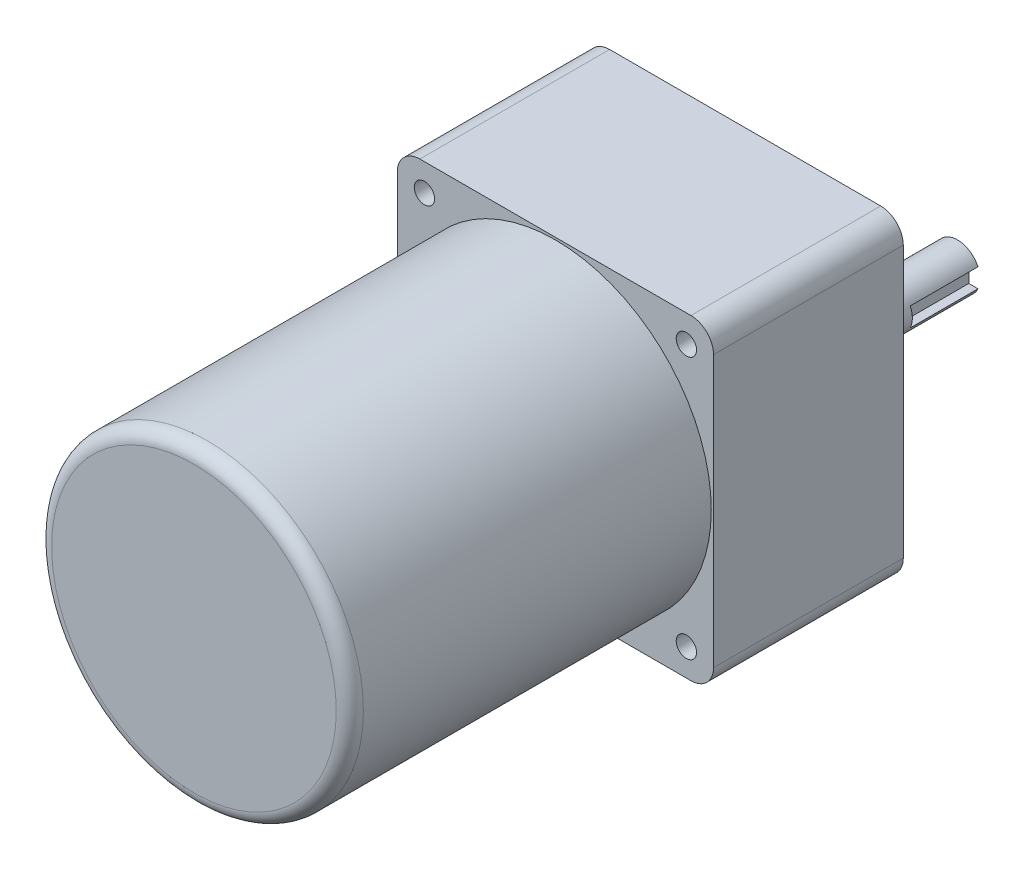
ISO-10303-21;
HEADER;
FILE_DESCRIPTION(('STEP AP214'),'2;1');
FILE_NAME('part.step','',(''),(''),'','','');
FILE_SCHEMA(('AUTOMOTIVE_DESIGN { 1 0 10303 214 1 1 1 1 }'));
ENDSEC;
DATA;
#1=APPLICATION_CONTEXT('core data for automotive mechanical design processes');
#2=APPLICATION_PROTOCOL_DEFINITION('international standard','automotive_design',2000,#1);
#3=PRODUCT_CONTEXT('',#1,'mechanical');
#4=PRODUCT('Part','Part','',(#3));
#5=PRODUCT_RELATED_PRODUCT_CATEGORY('part','',(#4));
#6=PRODUCT_DEFINITION_FORMATION('','',#4);
#7=PRODUCT_DEFINITION_CONTEXT('part definition',#1,'design');
#8=PRODUCT_DEFINITION('design','',#6,#7);
#9=PRODUCT_DEFINITION_SHAPE('','',#8);
#10=(LENGTH_UNIT() NAMED_UNIT(*) SI_UNIT(.MILLI.,.METRE.));
#11=(NAMED_UNIT(*) PLANE_ANGLE_UNIT() SI_UNIT($,.RADIAN.));
#12=(NAMED_UNIT(*) SI_UNIT($,.STERADIAN.) SOLID_ANGLE_UNIT());
#13=UNCERTAINTY_MEASURE_WITH_UNIT(LENGTH_MEASURE(1.E-05),#10,'distance_accuracy_value','');
#14=(GEOMETRIC_REPRESENTATION_CONTEXT(3) GLOBAL_UNCERTAINTY_ASSIGNED_CONTEXT((#13)) GLOBAL_UNIT_ASSIGNED_CONTEXT((#10,
#11,#12)) REPRESENTATION_CONTEXT('',''));
#15=CARTESIAN_POINT('',(0.,0.,0.));
#16=DIRECTION('',(0.,0.,1.));
#17=DIRECTION('',(1.,0.,0.));
#18=AXIS2_PLACEMENT_3D('',#15,#16,#17);
#19=CARTESIAN_POINT('',(15.0000000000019,0.,-3.));
#20=DIRECTION('',(0.,0.,-1.));
#21=DIRECTION('',(-1.,0.,0.));
#22=AXIS2_PLACEMENT_3D('',#19,#20,#21);
#23=PLANE('',#22);
#24=CARTESIAN_POINT('',(15.0000000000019,0.,-3.));
#25=DIRECTION('',(0.,0.,-1.));
#26=DIRECTION('',(-1.,0.,0.));
#27=AXIS2_PLACEMENT_3D('',#24,#25,#26);
#28=CIRCLE('',#27,14.5);
#29=CARTESIAN_POINT('',(0.500000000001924,0.,-3.));
#30=VERTEX_POINT('',#29);
#31=EDGE_CURVE('E42',#30,#30,#28,.T.);
#32=ORIENTED_EDGE('',*,*,#31,.T.);
#33=EDGE_LOOP('',(#32));
#34=FACE_BOUND('',#33,.T.);
#35=CARTESIAN_POINT('',(15.0000000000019,0.,-3.));
#36=DIRECTION('',(0.,0.,-1.));
#37=DIRECTION('',(-1.,0.,0.));
#38=AXIS2_PLACEMENT_3D('',#35,#36,#37);
#39=CIRCLE('',#38,5.);
#40=CARTESIAN_POINT('',(10.0000000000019,0.,-3.));
#41=VERTEX_POINT('',#40);
#42=EDGE_CURVE('E290',#41,#41,#39,.T.);
#43=ORIENTED_EDGE('',*,*,#42,.F.);
#44=EDGE_LOOP('',(#43));
#45=FACE_BOUND('',#44,.T.);
#46=ADVANCED_FACE('F34',(#34,#45),#23,.T.);
#47=CARTESIAN_POINT('',(-29.9999999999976,-30.0000000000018,0.));
#48=DIRECTION('',(0.,0.,1.));
#49=DIRECTION('',(1.,0.,0.));
#50=AXIS2_PLACEMENT_3D('',#47,#48,#49);
#51=PLANE('',#50);
#52=CARTESIAN_POINT('',(28.9913780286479,-28.9913780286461,0.));
#53=DIRECTION('',(0.,0.,1.));
#54=DIRECTION('',(1.,0.,0.));
#55=AXIS2_PLACEMENT_3D('',#52,#53,#54);
#56=CIRCLE('',#55,2.25000000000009);
#57=CARTESIAN_POINT('',(26.7413780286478,-28.9913780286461,0.));
#58=VERTEX_POINT('',#57);
#59=EDGE_CURVE('E283',#58,#58,#56,.T.);
#60=ORIENTED_EDGE('',*,*,#59,.T.);
#61=EDGE_LOOP('',(#60));
#62=FACE_BOUND('',#61,.T.);
#63=CARTESIAN_POINT('',(-28.9913780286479,28.9913780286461,0.));
#64=DIRECTION('',(0.,0.,1.));
#65=DIRECTION('',(1.,0.,0.));
#66=AXIS2_PLACEMENT_3D('',#63,#64,#65);
#67=CIRCLE('',#66,2.25000000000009);
#68=CARTESIAN_POINT('',(-31.241378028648,28.9913780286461,0.));
#69=VERTEX_POINT('',#68);
#70=EDGE_CURVE('E300',#69,#69,#67,.T.);
#71=ORIENTED_EDGE('',*,*,#70,.T.);
#72=EDGE_LOOP('',(#71));
#73=FACE_BOUND('',#72,.T.);
#74=CARTESIAN_POINT('',(-29.9999999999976,-30.0000000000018,0.));
#75=DIRECTION('',(0.,0.,1.));
#76=DIRECTION('',(1.,0.,0.));
#77=AXIS2_PLACEMENT_3D('',#74,#75,#76);
#78=CIRCLE('',#77,5.00000000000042);
#79=CARTESIAN_POINT('',(-34.9999999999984,-30.0000000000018,0.));
#80=VERTEX_POINT('',#79);
#81=CARTESIAN_POINT('',(-29.9999999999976,-35.0000000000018,0.));
#82=VERTEX_POINT('',#81);
#83=EDGE_CURVE('E145',#80,#82,#78,.T.);
#84=ORIENTED_EDGE('',*,*,#83,.F.);
#85=DIRECTION('',(0.,-1.,0.));
#86=VECTOR('',#85,1.);
#87=CARTESIAN_POINT('',(-34.9999999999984,-30.0000000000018,0.));
#88=LINE('',#87,#86);
#89=CARTESIAN_POINT('',(-34.9999999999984,30.,0.));
#90=VERTEX_POINT('',#89);
#91=EDGE_CURVE('E91',#90,#80,#88,.T.);
#92=ORIENTED_EDGE('',*,*,#91,.F.);
#93=CARTESIAN_POINT('',(-30.0000000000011,30.,0.));
#94=DIRECTION('',(0.,0.,1.));
#95=DIRECTION('',(1.,0.,0.));
#96=AXIS2_PLACEMENT_3D('',#93,#94,#95);
#97=CIRCLE('',#96,4.99999999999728);
#98=CARTESIAN_POINT('',(-30.0000000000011,34.9999999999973,0.));
#99=VERTEX_POINT('',#98);
#100=EDGE_CURVE('E158',#99,#90,#97,.T.);
#101=ORIENTED_EDGE('',*,*,#100,.F.);
#102=DIRECTION('',(-1.,0.,0.));
#103=VECTOR('',#102,1.);
#104=CARTESIAN_POINT('',(30.0000000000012,34.9999999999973,0.));
#105=LINE('',#104,#103);
#106=CARTESIAN_POINT('',(30.0000000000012,34.9999999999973,0.));
#107=VERTEX_POINT('',#106);
#108=EDGE_CURVE('E133',#107,#99,#105,.T.);
#109=ORIENTED_EDGE('',*,*,#108,.F.);
#110=CARTESIAN_POINT('',(30.0000000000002,29.9999999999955,0.));
#111=DIRECTION('',(0.,0.,1.));
#112=DIRECTION('',(1.,0.,0.));
#113=AXIS2_PLACEMENT_3D('',#110,#111,#112);
#114=CIRCLE('',#113,5.0000000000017);
#115=CARTESIAN_POINT('',(35.0000000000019,30.,0.));
#116=VERTEX_POINT('',#115);
#117=EDGE_CURVE('E155',#116,#107,#114,.T.);
#118=ORIENTED_EDGE('',*,*,#117,.F.);
#119=DIRECTION('',(0.,1.,0.));
#120=VECTOR('',#119,1.);
#121=CARTESIAN_POINT('',(35.0000000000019,-30.0000000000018,0.));
#122=LINE('',#121,#120);
#123=CARTESIAN_POINT('',(35.0000000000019,-30.0000000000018,0.));
#124=VERTEX_POINT('',#123);
#125=EDGE_CURVE('E153',#124,#116,#122,.T.);
#126=ORIENTED_EDGE('',*,*,#125,.F.);
#127=CARTESIAN_POINT('',(30.000000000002,-30.0000000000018,0.));
#128=DIRECTION('',(0.,0.,1.));
#129=DIRECTION('',(1.,0.,0.));
#130=AXIS2_PLACEMENT_3D('',#127,#128,#129);
#131=CIRCLE('',#130,4.99999999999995);
#132=CARTESIAN_POINT('',(30.000000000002,-35.0000000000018,0.));
#133=VERTEX_POINT('',#132);
#134=EDGE_CURVE('E151',#133,#124,#131,.T.);
#135=ORIENTED_EDGE('',*,*,#134,.F.);
#136=DIRECTION('',(1.,0.,0.));
#137=VECTOR('',#136,1.);
#138=CARTESIAN_POINT('',(30.000000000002,-35.0000000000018,0.));
#139=LINE('',#138,#137);
#140=EDGE_CURVE('E148',#82,#133,#139,.T.);
#141=ORIENTED_EDGE('',*,*,#140,.F.);
#142=EDGE_LOOP('',(#84,#92,#101,#109,#118,#126,#135,#141));
#143=FACE_BOUND('',#142,.T.);
#144=CARTESIAN_POINT('',(28.9913780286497,28.9913780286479,0.));
#145=DIRECTION('',(0.,0.,1.));
#146=DIRECTION('',(1.,0.,0.));
#147=AXIS2_PLACEMENT_3D('',#144,#145,#146);
#148=CIRCLE('',#147,2.25000000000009);
#149=CARTESIAN_POINT('',(26.7413780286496,28.9913780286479,0.));
#150=VERTEX_POINT('',#149);
#151=EDGE_CURVE('E306',#150,#150,#148,.T.);
#152=ORIENTED_EDGE('',*,*,#151,.T.);
#153=EDGE_LOOP('',(#152));
#154=FACE_BOUND('',#153,.T.);
#155=CARTESIAN_POINT('',(-28.9913780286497,-28.9913780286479,0.));
#156=DIRECTION('',(0.,0.,1.));
#157=DIRECTION('',(1.,0.,0.));
#158=AXIS2_PLACEMENT_3D('',#155,#156,#157);
#159=CIRCLE('',#158,2.25000000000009);
#160=CARTESIAN_POINT('',(-31.2413780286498,-28.9913780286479,0.));
#161=VERTEX_POINT('',#160);
#162=EDGE_CURVE('E295',#161,#161,#159,.T.);
#163=ORIENTED_EDGE('',*,*,#162,.T.);
#164=EDGE_LOOP('',(#163));
#165=FACE_BOUND('',#164,.T.);
#166=CARTESIAN_POINT('',(15.0000000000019,0.,0.));
#167=DIRECTION('',(0.,0.,1.));
#168=DIRECTION('',(1.,0.,0.));
#169=AXIS2_PLACEMENT_3D('',#166,#167,#168);
#170=CIRCLE('',#169,15.);
#171=CARTESIAN_POINT('',(30.0000000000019,0.,0.));
#172=VERTEX_POINT('',#171);
#173=EDGE_CURVE('E182',#172,#172,#170,.F.);
#174=ORIENTED_EDGE('',*,*,#173,.F.);
#175=EDGE_LOOP('',(#174));
#176=FACE_BOUND('',#175,.T.);
#177=ADVANCED_FACE('F205',(#62,#73,#143,#154,#165,#176),#51,.F.);
#178=CARTESIAN_POINT('',(-29.9999999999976,-30.0000000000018,42.));
#179=DIRECTION('',(0.,0.,1.));
#180=DIRECTION('',(1.,0.,0.));
#181=AXIS2_PLACEMENT_3D('',#178,#179,#180);
#182=PLANE('',#181);
#183=CARTESIAN_POINT('',(28.9913780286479,-28.9913780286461,42.));
#184=DIRECTION('',(0.,0.,1.));
#185=DIRECTION('',(1.,0.,0.));
#186=AXIS2_PLACEMENT_3D('',#183,#184,#185);
#187=CIRCLE('',#186,2.25000000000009);
#188=CARTESIAN_POINT('',(26.7413780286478,-28.9913780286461,42.));
#189=VERTEX_POINT('',#188);
#190=EDGE_CURVE('E287',#189,#189,#187,.T.);
#191=ORIENTED_EDGE('',*,*,#190,.F.);
#192=EDGE_LOOP('',(#191));
#193=FACE_BOUND('',#192,.T.);
#194=CARTESIAN_POINT('',(-28.9913780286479,28.9913780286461,42.));
#195=DIRECTION('',(0.,0.,1.));
#196=DIRECTION('',(1.,0.,0.));
#197=AXIS2_PLACEMENT_3D('',#194,#195,#196);
#198=CIRCLE('',#197,2.25000000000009);
#199=CARTESIAN_POINT('',(-31.241378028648,28.9913780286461,42.));
#200=VERTEX_POINT('',#199);
#201=EDGE_CURVE('E303',#200,#200,#198,.T.);
#202=ORIENTED_EDGE('',*,*,#201,.F.);
#203=EDGE_LOOP('',(#202));
#204=FACE_BOUND('',#203,.T.);
#205=CARTESIAN_POINT('',(-29.9999999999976,-30.0000000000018,42.));
#206=DIRECTION('',(0.,0.,1.));
#207=DIRECTION('',(1.,0.,0.));
#208=AXIS2_PLACEMENT_3D('',#205,#206,#207);
#209=CIRCLE('',#208,5.00000000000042);
#210=CARTESIAN_POINT('',(-34.9999999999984,-30.0000000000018,42.));
#211=VERTEX_POINT('',#210);
#212=CARTESIAN_POINT('',(-29.9999999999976,-35.0000000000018,42.));
#213=VERTEX_POINT('',#212);
#214=EDGE_CURVE('E161',#211,#213,#209,.T.);
#215=ORIENTED_EDGE('',*,*,#214,.T.);
#216=DIRECTION('',(1.,0.,0.));
#217=VECTOR('',#216,1.);
#218=CARTESIAN_POINT('',(30.000000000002,-35.0000000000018,42.));
#219=LINE('',#218,#217);
#220=CARTESIAN_POINT('',(30.000000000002,-35.0000000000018,42.));
#221=VERTEX_POINT('',#220);
#222=EDGE_CURVE('E100',#213,#221,#219,.T.);
#223=ORIENTED_EDGE('',*,*,#222,.T.);
#224=CARTESIAN_POINT('',(30.000000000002,-30.0000000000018,42.));
#225=DIRECTION('',(0.,0.,1.));
#226=DIRECTION('',(1.,0.,0.));
#227=AXIS2_PLACEMENT_3D('',#224,#225,#226);
#228=CIRCLE('',#227,4.99999999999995);
#229=CARTESIAN_POINT('',(35.0000000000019,-30.0000000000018,42.));
#230=VERTEX_POINT('',#229);
#231=EDGE_CURVE('E315',#221,#230,#228,.T.);
#232=ORIENTED_EDGE('',*,*,#231,.T.);
#233=DIRECTION('',(0.,1.,0.));
#234=VECTOR('',#233,1.);
#235=CARTESIAN_POINT('',(35.0000000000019,-30.0000000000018,42.));
#236=LINE('',#235,#234);
#237=CARTESIAN_POINT('',(35.0000000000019,30.,42.));
#238=VERTEX_POINT('',#237);
#239=EDGE_CURVE('E317',#230,#238,#236,.T.);
#240=ORIENTED_EDGE('',*,*,#239,.T.);
#241=CARTESIAN_POINT('',(30.0000000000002,29.9999999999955,42.));
#242=DIRECTION('',(0.,0.,1.));
#243=DIRECTION('',(1.,0.,0.));
#244=AXIS2_PLACEMENT_3D('',#241,#242,#243);
#245=CIRCLE('',#244,5.0000000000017);
#246=CARTESIAN_POINT('',(30.0000000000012,34.9999999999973,42.));
#247=VERTEX_POINT('',#246);
#248=EDGE_CURVE('E124',#238,#247,#245,.T.);
#249=ORIENTED_EDGE('',*,*,#248,.T.);
#250=DIRECTION('',(-1.,0.,0.));
#251=VECTOR('',#250,1.);
#252=CARTESIAN_POINT('',(30.0000000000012,34.9999999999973,42.));
#253=LINE('',#252,#251);
#254=CARTESIAN_POINT('',(-30.0000000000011,34.9999999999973,42.));
#255=VERTEX_POINT('',#254);
#256=EDGE_CURVE('E116',#247,#255,#253,.T.);
#257=ORIENTED_EDGE('',*,*,#256,.T.);
#258=CARTESIAN_POINT('',(-30.0000000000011,30.,42.));
#259=DIRECTION('',(0.,0.,1.));
#260=DIRECTION('',(1.,0.,0.));
#261=AXIS2_PLACEMENT_3D('',#258,#259,#260);
#262=CIRCLE('',#261,4.99999999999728);
#263=CARTESIAN_POINT('',(-34.9999999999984,30.,42.));
#264=VERTEX_POINT('',#263);
#265=EDGE_CURVE('E121',#255,#264,#262,.T.);
#266=ORIENTED_EDGE('',*,*,#265,.T.);
#267=DIRECTION('',(0.,-1.,0.));
#268=VECTOR('',#267,1.);
#269=CARTESIAN_POINT('',(-34.9999999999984,-30.0000000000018,42.));
#270=LINE('',#269,#268);
#271=EDGE_CURVE('E58',#264,#211,#270,.T.);
#272=ORIENTED_EDGE('',*,*,#271,.T.);
#273=EDGE_LOOP('',(#215,#223,#232,#240,#249,#257,#266,#272));
#274=FACE_BOUND('',#273,.T.);
#275=CARTESIAN_POINT('',(28.9913780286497,28.9913780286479,42.));
#276=DIRECTION('',(0.,0.,1.));
#277=DIRECTION('',(1.,0.,0.));
#278=AXIS2_PLACEMENT_3D('',#275,#276,#277);
#279=CIRCLE('',#278,2.25000000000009);
#280=CARTESIAN_POINT('',(26.7413780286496,28.9913780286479,42.));
#281=VERTEX_POINT('',#280);
#282=EDGE_CURVE('E149',#281,#281,#279,.T.);
#283=ORIENTED_EDGE('',*,*,#282,.F.);
#284=EDGE_LOOP('',(#283));
#285=FACE_BOUND('',#284,.T.);
#286=CARTESIAN_POINT('',(-28.9913780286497,-28.9913780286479,42.));
#287=DIRECTION('',(0.,0.,1.));
#288=DIRECTION('',(1.,0.,0.));
#289=AXIS2_PLACEMENT_3D('',#286,#287,#288);
#290=CIRCLE('',#289,2.25000000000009);
#291=CARTESIAN_POINT('',(-31.2413780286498,-28.9913780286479,42.));
#292=VERTEX_POINT('',#291);
#293=EDGE_CURVE('E297',#292,#292,#290,.T.);
#294=ORIENTED_EDGE('',*,*,#293,.F.);
#295=EDGE_LOOP('',(#294));
#296=FACE_BOUND('',#295,.T.);
#297=CARTESIAN_POINT('',(1.77635683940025E-12,0.,42.));
#298=DIRECTION('',(0.,0.,1.));
#299=DIRECTION('',(1.,0.,0.));
#300=AXIS2_PLACEMENT_3D('',#297,#298,#299);
#301=CIRCLE('',#300,34.5);
#302=CARTESIAN_POINT('',(34.5000000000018,0.,42.));
#303=VERTEX_POINT('',#302);
#304=EDGE_CURVE('E281',#303,#303,#301,.T.);
#305=ORIENTED_EDGE('',*,*,#304,.F.);
#306=EDGE_LOOP('',(#305));
#307=FACE_BOUND('',#306,.T.);
#308=ADVANCED_FACE('F118',(#193,#204,#274,#285,#296,#307),#182,.T.);
#309=CARTESIAN_POINT('',(-29.9999999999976,-30.0000000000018,42.));
#310=DIRECTION('',(0.,0.,-1.));
#311=DIRECTION('',(-1.,0.,0.));
#312=AXIS2_PLACEMENT_3D('',#309,#310,#311);
#313=CYLINDRICAL_SURFACE('',#312,5.00000000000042);
#314=ORIENTED_EDGE('',*,*,#83,.T.);
#315=DIRECTION('',(0.,0.,-1.));
#316=VECTOR('',#315,1.);
#317=CARTESIAN_POINT('',(-29.9999999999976,-35.0000000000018,42.));
#318=LINE('',#317,#316);
#319=EDGE_CURVE('E174',#213,#82,#318,.T.);
#320=ORIENTED_EDGE('',*,*,#319,.F.);
#321=ORIENTED_EDGE('',*,*,#214,.F.);
#322=DIRECTION('',(0.,0.,-1.));
#323=VECTOR('',#322,1.);
#324=CARTESIAN_POINT('',(-34.9999999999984,-30.0000000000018,42.));
#325=LINE('',#324,#323);
#326=EDGE_CURVE('E141',#211,#80,#325,.T.);
#327=ORIENTED_EDGE('',*,*,#326,.T.);
#328=EDGE_LOOP('',(#314,#320,#321,#327));
#329=FACE_BOUND('',#328,.T.);
#330=ADVANCED_FACE('F245',(#329),#313,.T.);
#331=CARTESIAN_POINT('',(30.000000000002,-35.0000000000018,42.));
#332=DIRECTION('',(0.,1.,0.));
#333=DIRECTION('',(0.,0.,1.));
#334=AXIS2_PLACEMENT_3D('',#331,#332,#333);
#335=PLANE('',#334);
#336=ORIENTED_EDGE('',*,*,#140,.T.);
#337=DIRECTION('',(0.,0.,-1.));
#338=VECTOR('',#337,1.);
#339=CARTESIAN_POINT('',(30.000000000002,-35.0000000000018,42.));
#340=LINE('',#339,#338);
#341=EDGE_CURVE('E171',#221,#133,#340,.T.);
#342=ORIENTED_EDGE('',*,*,#341,.F.);
#343=ORIENTED_EDGE('',*,*,#222,.F.);
#344=ORIENTED_EDGE('',*,*,#319,.T.);
#345=EDGE_LOOP('',(#336,#342,#343,#344));
#346=FACE_BOUND('',#345,.T.);
#347=ADVANCED_FACE('F265',(#346),#335,.F.);
#348=CARTESIAN_POINT('',(30.000000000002,-30.0000000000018,42.));
#349=DIRECTION('',(0.,0.,-1.));
#350=DIRECTION('',(-1.,0.,0.));
#351=AXIS2_PLACEMENT_3D('',#348,#349,#350);
#352=CYLINDRICAL_SURFACE('',#351,4.99999999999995);
#353=ORIENTED_EDGE('',*,*,#134,.T.);
#354=DIRECTION('',(0.,0.,-1.));
#355=VECTOR('',#354,1.);
#356=CARTESIAN_POINT('',(35.0000000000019,-30.0000000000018,42.));
#357=LINE('',#356,#355);
#358=EDGE_CURVE('E168',#230,#124,#357,.T.);
#359=ORIENTED_EDGE('',*,*,#358,.F.);
#360=ORIENTED_EDGE('',*,*,#231,.F.);
#361=ORIENTED_EDGE('',*,*,#341,.T.);
#362=EDGE_LOOP('',(#353,#359,#360,#361));
#363=FACE_BOUND('',#362,.T.);
#364=ADVANCED_FACE('F261',(#363),#352,.T.);
#365=CARTESIAN_POINT('',(35.0000000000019,-30.0000000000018,42.));
#366=DIRECTION('',(-1.,0.,0.));
#367=DIRECTION('',(0.,0.,1.));
#368=AXIS2_PLACEMENT_3D('',#365,#366,#367);
#369=PLANE('',#368);
#370=ORIENTED_EDGE('',*,*,#125,.T.);
#371=DIRECTION('',(0.,0.,-1.));
#372=VECTOR('',#371,1.);
#373=CARTESIAN_POINT('',(35.0000000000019,30.,42.));
#374=LINE('',#373,#372);
#375=EDGE_CURVE('E165',#238,#116,#374,.T.);
#376=ORIENTED_EDGE('',*,*,#375,.F.);
#377=ORIENTED_EDGE('',*,*,#239,.F.);
#378=ORIENTED_EDGE('',*,*,#358,.T.);
#379=EDGE_LOOP('',(#370,#376,#377,#378));
#380=FACE_BOUND('',#379,.T.);
#381=ADVANCED_FACE('F257',(#380),#369,.F.);
#382=CARTESIAN_POINT('',(30.0000000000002,29.9999999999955,42.));
#383=DIRECTION('',(0.,0.,-1.));
#384=DIRECTION('',(-1.,0.,0.));
#385=AXIS2_PLACEMENT_3D('',#382,#383,#384);
#386=CYLINDRICAL_SURFACE('',#385,5.0000000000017);
#387=ORIENTED_EDGE('',*,*,#117,.T.);
#388=DIRECTION('',(0.,0.,-1.));
#389=VECTOR('',#388,1.);
#390=CARTESIAN_POINT('',(30.0000000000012,34.9999999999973,42.));
#391=LINE('',#390,#389);
#392=EDGE_CURVE('E136',#247,#107,#391,.T.);
#393=ORIENTED_EDGE('',*,*,#392,.F.);
#394=ORIENTED_EDGE('',*,*,#248,.F.);
#395=ORIENTED_EDGE('',*,*,#375,.T.);
#396=EDGE_LOOP('',(#387,#393,#394,#395));
#397=FACE_BOUND('',#396,.T.);
#398=ADVANCED_FACE('F254',(#397),#386,.T.);
#399=CARTESIAN_POINT('',(30.0000000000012,34.9999999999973,42.));
#400=DIRECTION('',(0.,-1.,0.));
#401=DIRECTION('',(0.,0.,-1.));
#402=AXIS2_PLACEMENT_3D('',#399,#400,#401);
#403=PLANE('',#402);
#404=ORIENTED_EDGE('',*,*,#108,.T.);
#405=DIRECTION('',(0.,0.,-1.));
#406=VECTOR('',#405,1.);
#407=CARTESIAN_POINT('',(-30.0000000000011,34.9999999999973,42.));
#408=LINE('',#407,#406);
#409=EDGE_CURVE('E130',#255,#99,#408,.T.);
#410=ORIENTED_EDGE('',*,*,#409,.F.);
#411=ORIENTED_EDGE('',*,*,#256,.F.);
#412=ORIENTED_EDGE('',*,*,#392,.T.);
#413=EDGE_LOOP('',(#404,#410,#411,#412));
#414=FACE_BOUND('',#413,.T.);
#415=ADVANCED_FACE('F131',(#414),#403,.F.);
#416=CARTESIAN_POINT('',(-30.0000000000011,30.,42.));
#417=DIRECTION('',(0.,0.,-1.));
#418=DIRECTION('',(-1.,0.,0.));
#419=AXIS2_PLACEMENT_3D('',#416,#417,#418);
#420=CYLINDRICAL_SURFACE('',#419,4.99999999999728);
#421=ORIENTED_EDGE('',*,*,#100,.T.);
#422=DIRECTION('',(0.,0.,-1.));
#423=VECTOR('',#422,1.);
#424=CARTESIAN_POINT('',(-34.9999999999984,30.,42.));
#425=LINE('',#424,#423);
#426=EDGE_CURVE('E137',#264,#90,#425,.T.);
#427=ORIENTED_EDGE('',*,*,#426,.F.);
#428=ORIENTED_EDGE('',*,*,#265,.F.);
#429=ORIENTED_EDGE('',*,*,#409,.T.);
#430=EDGE_LOOP('',(#421,#427,#428,#429));
#431=FACE_BOUND('',#430,.T.);
#432=ADVANCED_FACE('F139',(#431),#420,.T.);
#433=CARTESIAN_POINT('',(-34.9999999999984,-30.0000000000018,42.));
#434=DIRECTION('',(1.,0.,0.));
#435=DIRECTION('',(0.,0.,-1.));
#436=AXIS2_PLACEMENT_3D('',#433,#434,#435);
#437=PLANE('',#436);
#438=ORIENTED_EDGE('',*,*,#91,.T.);
#439=ORIENTED_EDGE('',*,*,#326,.F.);
#440=ORIENTED_EDGE('',*,*,#271,.F.);
#441=ORIENTED_EDGE('',*,*,#426,.T.);
#442=EDGE_LOOP('',(#438,#439,#440,#441));
#443=FACE_BOUND('',#442,.T.);
#444=ADVANCED_FACE('F242',(#443),#437,.F.);
#445=CARTESIAN_POINT('',(28.9913780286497,28.9913780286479,42.));
#446=DIRECTION('',(0.,0.,-1.));
#447=DIRECTION('',(-1.,0.,0.));
#448=AXIS2_PLACEMENT_3D('',#445,#446,#447);
#449=CYLINDRICAL_SURFACE('',#448,2.25000000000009);
#450=CARTESIAN_POINT('',(26.7413780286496,28.9913780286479,42.));
#451=CARTESIAN_POINT('',(26.7413780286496,28.9913780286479,41.5625));
#452=CARTESIAN_POINT('',(26.7413780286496,28.9913780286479,41.125));
#453=CARTESIAN_POINT('',(26.7413780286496,28.9913780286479,40.25));
#454=CARTESIAN_POINT('',(26.7413780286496,28.9913780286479,39.8125));
#455=CARTESIAN_POINT('',(26.7413780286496,28.9913780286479,38.9375));
#456=CARTESIAN_POINT('',(26.7413780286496,28.9913780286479,38.5));
#457=CARTESIAN_POINT('',(26.7413780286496,28.9913780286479,37.625));
#458=CARTESIAN_POINT('',(26.7413780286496,28.9913780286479,37.1875));
#459=CARTESIAN_POINT('',(26.7413780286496,28.9913780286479,36.3125));
#460=CARTESIAN_POINT('',(26.7413780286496,28.9913780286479,35.875));
#461=CARTESIAN_POINT('',(26.7413780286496,28.9913780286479,35.));
#462=CARTESIAN_POINT('',(26.7413780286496,28.9913780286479,34.5625));
#463=CARTESIAN_POINT('',(26.7413780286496,28.9913780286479,33.6875));
#464=CARTESIAN_POINT('',(26.7413780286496,28.9913780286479,33.25));
#465=CARTESIAN_POINT('',(26.7413780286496,28.9913780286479,32.375));
#466=CARTESIAN_POINT('',(26.7413780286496,28.9913780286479,31.9375));
#467=CARTESIAN_POINT('',(26.7413780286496,28.9913780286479,31.0625));
#468=CARTESIAN_POINT('',(26.7413780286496,28.9913780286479,30.625));
#469=CARTESIAN_POINT('',(26.7413780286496,28.9913780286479,29.75));
#470=CARTESIAN_POINT('',(26.7413780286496,28.9913780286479,29.3125));
#471=CARTESIAN_POINT('',(26.7413780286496,28.9913780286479,28.4375));
#472=CARTESIAN_POINT('',(26.7413780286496,28.9913780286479,28.));
#473=CARTESIAN_POINT('',(26.7413780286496,28.9913780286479,27.125));
#474=CARTESIAN_POINT('',(26.7413780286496,28.9913780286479,26.6875));
#475=CARTESIAN_POINT('',(26.7413780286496,28.9913780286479,25.8125));
#476=CARTESIAN_POINT('',(26.7413780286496,28.9913780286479,25.375));
#477=CARTESIAN_POINT('',(26.7413780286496,28.9913780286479,24.5));
#478=CARTESIAN_POINT('',(26.7413780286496,28.9913780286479,24.0625));
#479=CARTESIAN_POINT('',(26.7413780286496,28.9913780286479,23.1875));
#480=CARTESIAN_POINT('',(26.7413780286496,28.9913780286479,22.75));
#481=CARTESIAN_POINT('',(26.7413780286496,28.9913780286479,21.875));
#482=CARTESIAN_POINT('',(26.7413780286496,28.9913780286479,21.4375));
#483=CARTESIAN_POINT('',(26.7413780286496,28.9913780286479,20.5625));
#484=CARTESIAN_POINT('',(26.7413780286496,28.9913780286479,20.125));
#485=CARTESIAN_POINT('',(26.7413780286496,28.9913780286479,19.25));
#486=CARTESIAN_POINT('',(26.7413780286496,28.9913780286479,18.8125));
#487=CARTESIAN_POINT('',(26.7413780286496,28.9913780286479,17.9375));
#488=CARTESIAN_POINT('',(26.7413780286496,28.9913780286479,17.5));
#489=CARTESIAN_POINT('',(26.7413780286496,28.9913780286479,16.625));
#490=CARTESIAN_POINT('',(26.7413780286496,28.9913780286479,16.1875));
#491=CARTESIAN_POINT('',(26.7413780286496,28.9913780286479,15.3125));
#492=CARTESIAN_POINT('',(26.7413780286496,28.9913780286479,14.875));
#493=CARTESIAN_POINT('',(26.7413780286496,28.9913780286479,14.));
#494=CARTESIAN_POINT('',(26.7413780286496,28.9913780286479,13.5625));
#495=CARTESIAN_POINT('',(26.7413780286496,28.9913780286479,12.6875));
#496=CARTESIAN_POINT('',(26.7413780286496,28.9913780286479,12.25));
#497=CARTESIAN_POINT('',(26.7413780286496,28.9913780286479,11.375));
#498=CARTESIAN_POINT('',(26.7413780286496,28.9913780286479,10.9375));
#499=CARTESIAN_POINT('',(26.7413780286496,28.9913780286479,10.0625));
#500=CARTESIAN_POINT('',(26.7413780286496,28.9913780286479,9.625));
#501=CARTESIAN_POINT('',(26.7413780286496,28.9913780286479,8.75));
#502=CARTESIAN_POINT('',(26.7413780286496,28.9913780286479,8.3125));
#503=CARTESIAN_POINT('',(26.7413780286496,28.9913780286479,7.4375));
#504=CARTESIAN_POINT('',(26.7413780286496,28.9913780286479,7.));
#505=CARTESIAN_POINT('',(26.7413780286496,28.9913780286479,6.125));
#506=CARTESIAN_POINT('',(26.7413780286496,28.9913780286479,5.6875));
#507=CARTESIAN_POINT('',(26.7413780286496,28.9913780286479,4.8125));
#508=CARTESIAN_POINT('',(26.7413780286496,28.9913780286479,4.375));
#509=CARTESIAN_POINT('',(26.7413780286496,28.9913780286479,3.5));
#510=CARTESIAN_POINT('',(26.7413780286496,28.9913780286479,3.0625));
#511=CARTESIAN_POINT('',(26.7413780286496,28.9913780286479,2.1875));
#512=CARTESIAN_POINT('',(26.7413780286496,28.9913780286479,1.75));
#513=CARTESIAN_POINT('',(26.7413780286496,28.9913780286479,0.875000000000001));
#514=CARTESIAN_POINT('',(26.7413780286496,28.9913780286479,0.4375));
#515=CARTESIAN_POINT('',(26.7413780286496,28.9913780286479,0.));
#516=B_SPLINE_CURVE_WITH_KNOTS('',3,(#450,#451,#452,#453,#454,#455,#456,#457,#458,#459,#460,
#461,#462,#463,#464,#465,#466,#467,#468,#469,#470,#471,#472,#473,#474,#475,#476,#477,#478,#479,
#480,#481,#482,#483,#484,#485,#486,#487,#488,#489,#490,#491,#492,#493,#494,#495,#496,#497,#498,
#499,#500,#501,#502,#503,#504,#505,#506,#507,#508,#509,#510,#511,#512,#513,#514,#515),
.UNSPECIFIED.,.F.,.F.,(4,2,2,2,2,2,2,2,2,2,2,2,2,2,2,2,2,2,2,2,2,2,2,2,2,2,2,2,2,2,2,2,4),(0.,
1.31249999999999,2.625,3.9375,5.25,6.5625,7.87499999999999,9.18749999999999,10.5,11.8125,13.125,
14.4375,15.75,17.0625,18.375,19.6875,21.,22.3125,23.625,24.9375,26.25,27.5625,28.875,30.1875,
31.5,32.8125,34.125,35.4375,36.75,38.0625,39.375,40.6875,42.),.UNSPECIFIED.);
#517=EDGE_CURVE('BSEAM238',#281,#150,#516,.T.);
#518=ORIENTED_EDGE('',*,*,#282,.T.);
#519=ORIENTED_EDGE('',*,*,#151,.F.);
#520=ORIENTED_EDGE('',*,*,#517,.T.);
#521=ORIENTED_EDGE('',*,*,#517,.F.);
#522=EDGE_LOOP('',(#518,#520,#519,#521));
#523=FACE_BOUND('',#522,.T.);
#524=ADVANCED_FACE('F238',(#523),#449,.F.);
#525=CARTESIAN_POINT('',(-28.9913780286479,28.9913780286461,42.));
#526=DIRECTION('',(0.,0.,-1.));
#527=DIRECTION('',(-1.,0.,0.));
#528=AXIS2_PLACEMENT_3D('',#525,#526,#527);
#529=CYLINDRICAL_SURFACE('',#528,2.25000000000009);
#530=CARTESIAN_POINT('',(-31.241378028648,28.9913780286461,42.));
#531=CARTESIAN_POINT('',(-31.241378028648,28.9913780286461,41.5625));
#532=CARTESIAN_POINT('',(-31.241378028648,28.9913780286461,41.125));
#533=CARTESIAN_POINT('',(-31.241378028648,28.9913780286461,40.25));
#534=CARTESIAN_POINT('',(-31.241378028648,28.9913780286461,39.8125));
#535=CARTESIAN_POINT('',(-31.241378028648,28.9913780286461,38.9375));
#536=CARTESIAN_POINT('',(-31.241378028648,28.9913780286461,38.5));
#537=CARTESIAN_POINT('',(-31.241378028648,28.9913780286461,37.625));
#538=CARTESIAN_POINT('',(-31.241378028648,28.9913780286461,37.1875));
#539=CARTESIAN_POINT('',(-31.241378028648,28.9913780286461,36.3125));
#540=CARTESIAN_POINT('',(-31.241378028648,28.9913780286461,35.875));
#541=CARTESIAN_POINT('',(-31.241378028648,28.9913780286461,35.));
#542=CARTESIAN_POINT('',(-31.241378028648,28.9913780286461,34.5625));
#543=CARTESIAN_POINT('',(-31.241378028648,28.9913780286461,33.6875));
#544=CARTESIAN_POINT('',(-31.241378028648,28.9913780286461,33.25));
#545=CARTESIAN_POINT('',(-31.241378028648,28.9913780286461,32.375));
#546=CARTESIAN_POINT('',(-31.241378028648,28.9913780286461,31.9375));
#547=CARTESIAN_POINT('',(-31.241378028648,28.9913780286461,31.0625));
#548=CARTESIAN_POINT('',(-31.241378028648,28.9913780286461,30.625));
#549=CARTESIAN_POINT('',(-31.241378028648,28.9913780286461,29.75));
#550=CARTESIAN_POINT('',(-31.241378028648,28.9913780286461,29.3125));
#551=CARTESIAN_POINT('',(-31.241378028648,28.9913780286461,28.4375));
#552=CARTESIAN_POINT('',(-31.241378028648,28.9913780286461,28.));
#553=CARTESIAN_POINT('',(-31.241378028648,28.9913780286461,27.125));
#554=CARTESIAN_POINT('',(-31.241378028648,28.9913780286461,26.6875));
#555=CARTESIAN_POINT('',(-31.241378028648,28.9913780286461,25.8125));
#556=CARTESIAN_POINT('',(-31.241378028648,28.9913780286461,25.375));
#557=CARTESIAN_POINT('',(-31.241378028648,28.9913780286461,24.5));
#558=CARTESIAN_POINT('',(-31.241378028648,28.9913780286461,24.0625));
#559=CARTESIAN_POINT('',(-31.241378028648,28.9913780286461,23.1875));
#560=CARTESIAN_POINT('',(-31.241378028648,28.9913780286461,22.75));
#561=CARTESIAN_POINT('',(-31.241378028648,28.9913780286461,21.875));
#562=CARTESIAN_POINT('',(-31.241378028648,28.9913780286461,21.4375));
#563=CARTESIAN_POINT('',(-31.241378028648,28.9913780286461,20.5625));
#564=CARTESIAN_POINT('',(-31.241378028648,28.9913780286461,20.125));
#565=CARTESIAN_POINT('',(-31.241378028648,28.9913780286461,19.25));
#566=CARTESIAN_POINT('',(-31.241378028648,28.9913780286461,18.8125));
#567=CARTESIAN_POINT('',(-31.241378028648,28.9913780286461,17.9375));
#568=CARTESIAN_POINT('',(-31.241378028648,28.9913780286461,17.5));
#569=CARTESIAN_POINT('',(-31.241378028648,28.9913780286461,16.625));
#570=CARTESIAN_POINT('',(-31.241378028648,28.9913780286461,16.1875));
#571=CARTESIAN_POINT('',(-31.241378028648,28.9913780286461,15.3125));
#572=CARTESIAN_POINT('',(-31.241378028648,28.9913780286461,14.875));
#573=CARTESIAN_POINT('',(-31.241378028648,28.9913780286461,14.));
#574=CARTESIAN_POINT('',(-31.241378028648,28.9913780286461,13.5625));
#575=CARTESIAN_POINT('',(-31.241378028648,28.9913780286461,12.6875));
#576=CARTESIAN_POINT('',(-31.241378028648,28.9913780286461,12.25));
#577=CARTESIAN_POINT('',(-31.241378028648,28.9913780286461,11.375));
#578=CARTESIAN_POINT('',(-31.241378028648,28.9913780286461,10.9375));
#579=CARTESIAN_POINT('',(-31.241378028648,28.9913780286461,10.0625));
#580=CARTESIAN_POINT('',(-31.241378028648,28.9913780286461,9.625));
#581=CARTESIAN_POINT('',(-31.241378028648,28.9913780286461,8.75));
#582=CARTESIAN_POINT('',(-31.241378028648,28.9913780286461,8.3125));
#583=CARTESIAN_POINT('',(-31.241378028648,28.9913780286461,7.4375));
#584=CARTESIAN_POINT('',(-31.241378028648,28.9913780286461,7.));
#585=CARTESIAN_POINT('',(-31.241378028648,28.9913780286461,6.125));
#586=CARTESIAN_POINT('',(-31.241378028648,28.9913780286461,5.6875));
#587=CARTESIAN_POINT('',(-31.241378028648,28.9913780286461,4.8125));
#588=CARTESIAN_POINT('',(-31.241378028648,28.9913780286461,4.375));
#589=CARTESIAN_POINT('',(-31.241378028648,28.9913780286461,3.5));
#590=CARTESIAN_POINT('',(-31.241378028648,28.9913780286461,3.0625));
#591=CARTESIAN_POINT('',(-31.241378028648,28.9913780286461,2.1875));
#592=CARTESIAN_POINT('',(-31.241378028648,28.9913780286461,1.75));
#593=CARTESIAN_POINT('',(-31.241378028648,28.9913780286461,0.875000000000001));
#594=CARTESIAN_POINT('',(-31.241378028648,28.9913780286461,0.4375));
#595=CARTESIAN_POINT('',(-31.241378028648,28.9913780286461,0.));
#596=B_SPLINE_CURVE_WITH_KNOTS('',3,(#530,#531,#532,#533,#534,#535,#536,#537,#538,#539,#540,
#541,#542,#543,#544,#545,#546,#547,#548,#549,#550,#551,#552,#553,#554,#555,#556,#557,#558,#559,
#560,#561,#562,#563,#564,#565,#566,#567,#568,#569,#570,#571,#572,#573,#574,#575,#576,#577,#578,
#579,#580,#581,#582,#583,#584,#585,#586,#587,#588,#589,#590,#591,#592,#593,#594,#595),
.UNSPECIFIED.,.F.,.F.,(4,2,2,2,2,2,2,2,2,2,2,2,2,2,2,2,2,2,2,2,2,2,2,2,2,2,2,2,2,2,2,2,4),(0.,
1.31249999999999,2.625,3.9375,5.25,6.5625,7.87499999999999,9.18749999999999,10.5,11.8125,13.125,
14.4375,15.75,17.0625,18.375,19.6875,21.,22.3125,23.625,24.9375,26.25,27.5625,28.875,30.1875,
31.5,32.8125,34.125,35.4375,36.75,38.0625,39.375,40.6875,42.),.UNSPECIFIED.);
#597=EDGE_CURVE('BSEAM234',#200,#69,#596,.T.);
#598=ORIENTED_EDGE('',*,*,#201,.T.);
#599=ORIENTED_EDGE('',*,*,#70,.F.);
#600=ORIENTED_EDGE('',*,*,#597,.T.);
#601=ORIENTED_EDGE('',*,*,#597,.F.);
#602=EDGE_LOOP('',(#598,#600,#599,#601));
#603=FACE_BOUND('',#602,.T.);
#604=ADVANCED_FACE('F234',(#603),#529,.F.);
#605=CARTESIAN_POINT('',(-28.9913780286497,-28.9913780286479,42.));
#606=DIRECTION('',(0.,0.,-1.));
#607=DIRECTION('',(-1.,0.,0.));
#608=AXIS2_PLACEMENT_3D('',#605,#606,#607);
#609=CYLINDRICAL_SURFACE('',#608,2.25000000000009);
#610=CARTESIAN_POINT('',(-31.2413780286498,-28.9913780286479,42.));
#611=CARTESIAN_POINT('',(-31.2413780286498,-28.9913780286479,41.5625));
#612=CARTESIAN_POINT('',(-31.2413780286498,-28.9913780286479,41.125));
#613=CARTESIAN_POINT('',(-31.2413780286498,-28.9913780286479,40.25));
#614=CARTESIAN_POINT('',(-31.2413780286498,-28.9913780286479,39.8125));
#615=CARTESIAN_POINT('',(-31.2413780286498,-28.9913780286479,38.9375));
#616=CARTESIAN_POINT('',(-31.2413780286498,-28.9913780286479,38.5));
#617=CARTESIAN_POINT('',(-31.2413780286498,-28.9913780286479,37.625));
#618=CARTESIAN_POINT('',(-31.2413780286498,-28.9913780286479,37.1875));
#619=CARTESIAN_POINT('',(-31.2413780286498,-28.9913780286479,36.3125));
#620=CARTESIAN_POINT('',(-31.2413780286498,-28.9913780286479,35.875));
#621=CARTESIAN_POINT('',(-31.2413780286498,-28.9913780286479,35.));
#622=CARTESIAN_POINT('',(-31.2413780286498,-28.9913780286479,34.5625));
#623=CARTESIAN_POINT('',(-31.2413780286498,-28.9913780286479,33.6875));
#624=CARTESIAN_POINT('',(-31.2413780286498,-28.9913780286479,33.25));
#625=CARTESIAN_POINT('',(-31.2413780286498,-28.9913780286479,32.375));
#626=CARTESIAN_POINT('',(-31.2413780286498,-28.9913780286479,31.9375));
#627=CARTESIAN_POINT('',(-31.2413780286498,-28.9913780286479,31.0625));
#628=CARTESIAN_POINT('',(-31.2413780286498,-28.9913780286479,30.625));
#629=CARTESIAN_POINT('',(-31.2413780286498,-28.9913780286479,29.75));
#630=CARTESIAN_POINT('',(-31.2413780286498,-28.9913780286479,29.3125));
#631=CARTESIAN_POINT('',(-31.2413780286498,-28.9913780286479,28.4375));
#632=CARTESIAN_POINT('',(-31.2413780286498,-28.9913780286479,28.));
#633=CARTESIAN_POINT('',(-31.2413780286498,-28.9913780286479,27.125));
#634=CARTESIAN_POINT('',(-31.2413780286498,-28.9913780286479,26.6875));
#635=CARTESIAN_POINT('',(-31.2413780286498,-28.9913780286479,25.8125));
#636=CARTESIAN_POINT('',(-31.2413780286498,-28.9913780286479,25.375));
#637=CARTESIAN_POINT('',(-31.2413780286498,-28.9913780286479,24.5));
#638=CARTESIAN_POINT('',(-31.2413780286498,-28.9913780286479,24.0625));
#639=CARTESIAN_POINT('',(-31.2413780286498,-28.9913780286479,23.1875));
#640=CARTESIAN_POINT('',(-31.2413780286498,-28.9913780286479,22.75));
#641=CARTESIAN_POINT('',(-31.2413780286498,-28.9913780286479,21.875));
#642=CARTESIAN_POINT('',(-31.2413780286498,-28.9913780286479,21.4375));
#643=CARTESIAN_POINT('',(-31.2413780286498,-28.9913780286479,20.5625));
#644=CARTESIAN_POINT('',(-31.2413780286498,-28.9913780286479,20.125));
#645=CARTESIAN_POINT('',(-31.2413780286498,-28.9913780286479,19.25));
#646=CARTESIAN_POINT('',(-31.2413780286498,-28.9913780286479,18.8125));
#647=CARTESIAN_POINT('',(-31.2413780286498,-28.9913780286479,17.9375));
#648=CARTESIAN_POINT('',(-31.2413780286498,-28.9913780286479,17.5));
#649=CARTESIAN_POINT('',(-31.2413780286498,-28.9913780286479,16.625));
#650=CARTESIAN_POINT('',(-31.2413780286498,-28.9913780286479,16.1875));
#651=CARTESIAN_POINT('',(-31.2413780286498,-28.9913780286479,15.3125));
#652=CARTESIAN_POINT('',(-31.2413780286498,-28.9913780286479,14.875));
#653=CARTESIAN_POINT('',(-31.2413780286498,-28.9913780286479,14.));
#654=CARTESIAN_POINT('',(-31.2413780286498,-28.9913780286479,13.5625));
#655=CARTESIAN_POINT('',(-31.2413780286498,-28.9913780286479,12.6875));
#656=CARTESIAN_POINT('',(-31.2413780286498,-28.9913780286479,12.25));
#657=CARTESIAN_POINT('',(-31.2413780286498,-28.9913780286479,11.375));
#658=CARTESIAN_POINT('',(-31.2413780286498,-28.9913780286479,10.9375));
#659=CARTESIAN_POINT('',(-31.2413780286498,-28.9913780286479,10.0625));
#660=CARTESIAN_POINT('',(-31.2413780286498,-28.9913780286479,9.625));
#661=CARTESIAN_POINT('',(-31.2413780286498,-28.9913780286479,8.75));
#662=CARTESIAN_POINT('',(-31.2413780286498,-28.9913780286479,8.3125));
#663=CARTESIAN_POINT('',(-31.2413780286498,-28.9913780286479,7.4375));
#664=CARTESIAN_POINT('',(-31.2413780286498,-28.9913780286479,7.));
#665=CARTESIAN_POINT('',(-31.2413780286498,-28.9913780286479,6.125));
#666=CARTESIAN_POINT('',(-31.2413780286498,-28.9913780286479,5.6875));
#667=CARTESIAN_POINT('',(-31.2413780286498,-28.9913780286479,4.8125));
#668=CARTESIAN_POINT('',(-31.2413780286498,-28.9913780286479,4.375));
#669=CARTESIAN_POINT('',(-31.2413780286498,-28.9913780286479,3.5));
#670=CARTESIAN_POINT('',(-31.2413780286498,-28.9913780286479,3.0625));
#671=CARTESIAN_POINT('',(-31.2413780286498,-28.9913780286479,2.1875));
#672=CARTESIAN_POINT('',(-31.2413780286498,-28.9913780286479,1.75));
#673=CARTESIAN_POINT('',(-31.2413780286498,-28.9913780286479,0.875000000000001));
#674=CARTESIAN_POINT('',(-31.2413780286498,-28.9913780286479,0.4375));
#675=CARTESIAN_POINT('',(-31.2413780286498,-28.9913780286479,0.));
#676=B_SPLINE_CURVE_WITH_KNOTS('',3,(#610,#611,#612,#613,#614,#615,#616,#617,#618,#619,#620,
#621,#622,#623,#624,#625,#626,#627,#628,#629,#630,#631,#632,#633,#634,#635,#636,#637,#638,#639,
#640,#641,#642,#643,#644,#645,#646,#647,#648,#649,#650,#651,#652,#653,#654,#655,#656,#657,#658,
#659,#660,#661,#662,#663,#664,#665,#666,#667,#668,#669,#670,#671,#672,#673,#674,#675),
.UNSPECIFIED.,.F.,.F.,(4,2,2,2,2,2,2,2,2,2,2,2,2,2,2,2,2,2,2,2,2,2,2,2,2,2,2,2,2,2,2,2,4),(0.,
1.31249999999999,2.625,3.9375,5.25,6.5625,7.87499999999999,9.18749999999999,10.5,11.8125,13.125,
14.4375,15.75,17.0625,18.375,19.6875,21.,22.3125,23.625,24.9375,26.25,27.5625,28.875,30.1875,
31.5,32.8125,34.125,35.4375,36.75,38.0625,39.375,40.6875,42.),.UNSPECIFIED.);
#677=EDGE_CURVE('BSEAM230',#292,#161,#676,.T.);
#678=ORIENTED_EDGE('',*,*,#293,.T.);
#679=ORIENTED_EDGE('',*,*,#162,.F.);
#680=ORIENTED_EDGE('',*,*,#677,.T.);
#681=ORIENTED_EDGE('',*,*,#677,.F.);
#682=EDGE_LOOP('',(#678,#680,#679,#681));
#683=FACE_BOUND('',#682,.T.);
#684=ADVANCED_FACE('F230',(#683),#609,.F.);
#685=CARTESIAN_POINT('',(28.9913780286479,-28.9913780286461,42.));
#686=DIRECTION('',(0.,0.,-1.));
#687=DIRECTION('',(-1.,0.,0.));
#688=AXIS2_PLACEMENT_3D('',#685,#686,#687);
#689=CYLINDRICAL_SURFACE('',#688,2.25000000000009);
#690=CARTESIAN_POINT('',(26.7413780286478,-28.9913780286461,42.));
#691=CARTESIAN_POINT('',(26.7413780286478,-28.9913780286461,41.5625));
#692=CARTESIAN_POINT('',(26.7413780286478,-28.9913780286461,41.125));
#693=CARTESIAN_POINT('',(26.7413780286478,-28.9913780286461,40.25));
#694=CARTESIAN_POINT('',(26.7413780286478,-28.9913780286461,39.8125));
#695=CARTESIAN_POINT('',(26.7413780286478,-28.9913780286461,38.9375));
#696=CARTESIAN_POINT('',(26.7413780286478,-28.9913780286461,38.5));
#697=CARTESIAN_POINT('',(26.7413780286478,-28.9913780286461,37.625));
#698=CARTESIAN_POINT('',(26.7413780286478,-28.9913780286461,37.1875));
#699=CARTESIAN_POINT('',(26.7413780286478,-28.9913780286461,36.3125));
#700=CARTESIAN_POINT('',(26.7413780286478,-28.9913780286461,35.875));
#701=CARTESIAN_POINT('',(26.7413780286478,-28.9913780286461,35.));
#702=CARTESIAN_POINT('',(26.7413780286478,-28.9913780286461,34.5625));
#703=CARTESIAN_POINT('',(26.7413780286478,-28.9913780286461,33.6875));
#704=CARTESIAN_POINT('',(26.7413780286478,-28.9913780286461,33.25));
#705=CARTESIAN_POINT('',(26.7413780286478,-28.9913780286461,32.375));
#706=CARTESIAN_POINT('',(26.7413780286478,-28.9913780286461,31.9375));
#707=CARTESIAN_POINT('',(26.7413780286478,-28.9913780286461,31.0625));
#708=CARTESIAN_POINT('',(26.7413780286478,-28.9913780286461,30.625));
#709=CARTESIAN_POINT('',(26.7413780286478,-28.9913780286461,29.75));
#710=CARTESIAN_POINT('',(26.7413780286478,-28.9913780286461,29.3125));
#711=CARTESIAN_POINT('',(26.7413780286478,-28.9913780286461,28.4375));
#712=CARTESIAN_POINT('',(26.7413780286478,-28.9913780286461,28.));
#713=CARTESIAN_POINT('',(26.7413780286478,-28.9913780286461,27.125));
#714=CARTESIAN_POINT('',(26.7413780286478,-28.9913780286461,26.6875));
#715=CARTESIAN_POINT('',(26.7413780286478,-28.9913780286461,25.8125));
#716=CARTESIAN_POINT('',(26.7413780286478,-28.9913780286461,25.375));
#717=CARTESIAN_POINT('',(26.7413780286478,-28.9913780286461,24.5));
#718=CARTESIAN_POINT('',(26.7413780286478,-28.9913780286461,24.0625));
#719=CARTESIAN_POINT('',(26.7413780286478,-28.9913780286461,23.1875));
#720=CARTESIAN_POINT('',(26.7413780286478,-28.9913780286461,22.75));
#721=CARTESIAN_POINT('',(26.7413780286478,-28.9913780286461,21.875));
#722=CARTESIAN_POINT('',(26.7413780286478,-28.9913780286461,21.4375));
#723=CARTESIAN_POINT('',(26.7413780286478,-28.9913780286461,20.5625));
#724=CARTESIAN_POINT('',(26.7413780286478,-28.9913780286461,20.125));
#725=CARTESIAN_POINT('',(26.7413780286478,-28.9913780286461,19.25));
#726=CARTESIAN_POINT('',(26.7413780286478,-28.9913780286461,18.8125));
#727=CARTESIAN_POINT('',(26.7413780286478,-28.9913780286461,17.9375));
#728=CARTESIAN_POINT('',(26.7413780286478,-28.9913780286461,17.5));
#729=CARTESIAN_POINT('',(26.7413780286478,-28.9913780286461,16.625));
#730=CARTESIAN_POINT('',(26.7413780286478,-28.9913780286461,16.1875));
#731=CARTESIAN_POINT('',(26.7413780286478,-28.9913780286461,15.3125));
#732=CARTESIAN_POINT('',(26.7413780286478,-28.9913780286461,14.875));
#733=CARTESIAN_POINT('',(26.7413780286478,-28.9913780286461,14.));
#734=CARTESIAN_POINT('',(26.7413780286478,-28.9913780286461,13.5625));
#735=CARTESIAN_POINT('',(26.7413780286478,-28.9913780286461,12.6875));
#736=CARTESIAN_POINT('',(26.7413780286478,-28.9913780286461,12.25));
#737=CARTESIAN_POINT('',(26.7413780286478,-28.9913780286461,11.375));
#738=CARTESIAN_POINT('',(26.7413780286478,-28.9913780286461,10.9375));
#739=CARTESIAN_POINT('',(26.7413780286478,-28.9913780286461,10.0625));
#740=CARTESIAN_POINT('',(26.7413780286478,-28.9913780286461,9.625));
#741=CARTESIAN_POINT('',(26.7413780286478,-28.9913780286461,8.75));
#742=CARTESIAN_POINT('',(26.7413780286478,-28.9913780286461,8.3125));
#743=CARTESIAN_POINT('',(26.7413780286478,-28.9913780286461,7.4375));
#744=CARTESIAN_POINT('',(26.7413780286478,-28.9913780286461,7.));
#745=CARTESIAN_POINT('',(26.7413780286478,-28.9913780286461,6.125));
#746=CARTESIAN_POINT('',(26.7413780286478,-28.9913780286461,5.6875));
#747=CARTESIAN_POINT('',(26.7413780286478,-28.9913780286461,4.8125));
#748=CARTESIAN_POINT('',(26.7413780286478,-28.9913780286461,4.375));
#749=CARTESIAN_POINT('',(26.7413780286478,-28.9913780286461,3.5));
#750=CARTESIAN_POINT('',(26.7413780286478,-28.9913780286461,3.0625));
#751=CARTESIAN_POINT('',(26.7413780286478,-28.9913780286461,2.1875));
#752=CARTESIAN_POINT('',(26.7413780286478,-28.9913780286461,1.75));
#753=CARTESIAN_POINT('',(26.7413780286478,-28.9913780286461,0.875000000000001));
#754=CARTESIAN_POINT('',(26.7413780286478,-28.9913780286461,0.4375));
#755=CARTESIAN_POINT('',(26.7413780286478,-28.9913780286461,0.));
#756=B_SPLINE_CURVE_WITH_KNOTS('',3,(#690,#691,#692,#693,#694,#695,#696,#697,#698,#699,#700,
#701,#702,#703,#704,#705,#706,#707,#708,#709,#710,#711,#712,#713,#714,#715,#716,#717,#718,#719,
#720,#721,#722,#723,#724,#725,#726,#727,#728,#729,#730,#731,#732,#733,#734,#735,#736,#737,#738,
#739,#740,#741,#742,#743,#744,#745,#746,#747,#748,#749,#750,#751,#752,#753,#754,#755),
.UNSPECIFIED.,.F.,.F.,(4,2,2,2,2,2,2,2,2,2,2,2,2,2,2,2,2,2,2,2,2,2,2,2,2,2,2,2,2,2,2,2,4),(0.,
1.31249999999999,2.625,3.9375,5.25,6.5625,7.87499999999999,9.18749999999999,10.5,11.8125,13.125,
14.4375,15.75,17.0625,18.375,19.6875,21.,22.3125,23.625,24.9375,26.25,27.5625,28.875,30.1875,
31.5,32.8125,34.125,35.4375,36.75,38.0625,39.375,40.6875,42.),.UNSPECIFIED.);
#757=EDGE_CURVE('BSEAM226',#189,#58,#756,.T.);
#758=ORIENTED_EDGE('',*,*,#190,.T.);
#759=ORIENTED_EDGE('',*,*,#59,.F.);
#760=ORIENTED_EDGE('',*,*,#757,.T.);
#761=ORIENTED_EDGE('',*,*,#757,.F.);
#762=EDGE_LOOP('',(#758,#760,#759,#761));
#763=FACE_BOUND('',#762,.T.);
#764=ADVANCED_FACE('F226',(#763),#689,.F.);
#765=CARTESIAN_POINT('',(1.77635683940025E-12,0.,122.));
#766=DIRECTION('',(0.,0.,-1.));
#767=DIRECTION('',(-1.,0.,0.));
#768=AXIS2_PLACEMENT_3D('',#765,#766,#767);
#769=CYLINDRICAL_SURFACE('',#768,34.5);
#770=CARTESIAN_POINT('',(1.77635683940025E-12,0.,119.));
#771=DIRECTION('',(0.,0.,1.));
#772=DIRECTION('',(1.,0.,0.));
#773=AXIS2_PLACEMENT_3D('',#770,#771,#772);
#774=CIRCLE('',#773,34.5);
#775=CARTESIAN_POINT('',(34.5000000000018,0.,119.));
#776=VERTEX_POINT('',#775);
#777=EDGE_CURVE('E179',#776,#776,#774,.F.);
#778=ORIENTED_EDGE('',*,*,#777,.T.);
#779=EDGE_LOOP('',(#778));
#780=FACE_BOUND('',#779,.T.);
#781=ORIENTED_EDGE('',*,*,#304,.T.);
#782=EDGE_LOOP('',(#781));
#783=FACE_BOUND('',#782,.T.);
#784=ADVANCED_FACE('F222',(#780,#783),#769,.T.);
#785=CARTESIAN_POINT('',(1.77635683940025E-12,0.,122.));
#786=DIRECTION('',(0.,0.,1.));
#787=DIRECTION('',(1.,0.,0.));
#788=AXIS2_PLACEMENT_3D('',#785,#786,#787);
#789=PLANE('',#788);
#790=CARTESIAN_POINT('',(1.77635683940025E-12,0.,122.));
#791=DIRECTION('',(0.,0.,1.));
#792=DIRECTION('',(1.,0.,0.));
#793=AXIS2_PLACEMENT_3D('',#790,#791,#792);
#794=CIRCLE('',#793,31.5);
#795=CARTESIAN_POINT('',(31.5000000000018,0.,122.));
#796=VERTEX_POINT('',#795);
#797=EDGE_CURVE('E176',#796,#796,#794,.T.);
#798=ORIENTED_EDGE('',*,*,#797,.T.);
#799=EDGE_LOOP('',(#798));
#800=FACE_BOUND('',#799,.T.);
#801=ADVANCED_FACE('F219',(#800),#789,.T.);
#802=CARTESIAN_POINT('',(1.77635683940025E-12,0.,119.));
#803=DIRECTION('',(0.,0.,1.));
#804=DIRECTION('',(1.,0.,0.));
#805=AXIS2_PLACEMENT_3D('',#802,#803,#804);
#806=TOROIDAL_SURFACE('',#805,31.5,3.);
#807=ORIENTED_EDGE('',*,*,#777,.F.);
#808=EDGE_LOOP('',(#807));
#809=FACE_BOUND('',#808,.T.);
#810=ORIENTED_EDGE('',*,*,#797,.F.);
#811=EDGE_LOOP('',(#810));
#812=FACE_BOUND('',#811,.T.);
#813=ADVANCED_FACE('F217',(#809,#812),#806,.T.);
#814=CARTESIAN_POINT('',(15.0000000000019,0.,-3.));
#815=DIRECTION('',(0.,0.,1.));
#816=DIRECTION('',(1.,0.,0.));
#817=AXIS2_PLACEMENT_3D('',#814,#815,#816);
#818=CYLINDRICAL_SURFACE('',#817,15.);
#819=CARTESIAN_POINT('',(15.0000000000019,0.,-2.5));
#820=DIRECTION('',(0.,0.,-1.));
#821=DIRECTION('',(-1.,0.,0.));
#822=AXIS2_PLACEMENT_3D('',#819,#820,#821);
#823=CIRCLE('',#822,15.);
#824=CARTESIAN_POINT('',(1.92380833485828E-12,0.,-2.5));
#825=VERTEX_POINT('',#824);
#826=EDGE_CURVE('E11',#825,#825,#823,.F.);
#827=ORIENTED_EDGE('',*,*,#826,.T.);
#828=EDGE_LOOP('',(#827));
#829=FACE_BOUND('',#828,.T.);
#830=ORIENTED_EDGE('',*,*,#173,.T.);
#831=EDGE_LOOP('',(#830));
#832=FACE_BOUND('',#831,.T.);
#833=ADVANCED_FACE('F214',(#829,#832),#818,.T.);
#834=CARTESIAN_POINT('',(15.0000000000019,0.,-32.));
#835=DIRECTION('',(0.,0.,1.));
#836=DIRECTION('',(1.,0.,0.));
#837=AXIS2_PLACEMENT_3D('',#834,#835,#836);
#838=CYLINDRICAL_SURFACE('',#837,5.);
#839=CARTESIAN_POINT('',(15.0000000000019,0.,-17.));
#840=DIRECTION('',(0.,0.,-1.));
#841=DIRECTION('',(-1.,0.,0.));
#842=AXIS2_PLACEMENT_3D('',#839,#840,#841);
#843=CIRCLE('',#842,5.);
#844=CARTESIAN_POINT('',(19.5354222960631,2.10474335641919,-17.));
#845=VERTEX_POINT('',#844);
#846=CARTESIAN_POINT('',(19.5354222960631,-2.10474335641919,-17.));
#847=VERTEX_POINT('',#846);
#848=EDGE_CURVE('E365',#845,#847,#843,.T.);
#849=ORIENTED_EDGE('',*,*,#848,.F.);
#850=DIRECTION('',(0.,0.,-1.));
#851=VECTOR('',#850,1.);
#852=CARTESIAN_POINT('',(19.5354222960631,2.10474335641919,-17.));
#853=LINE('',#852,#851);
#854=CARTESIAN_POINT('',(19.5354222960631,2.10474335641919,-32.));
#855=VERTEX_POINT('',#854);
#856=EDGE_CURVE('E350',#845,#855,#853,.T.);
#857=ORIENTED_EDGE('',*,*,#856,.T.);
#858=CARTESIAN_POINT('',(15.0000000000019,0.,-32.));
#859=DIRECTION('',(0.,0.,-1.));
#860=DIRECTION('',(-1.,0.,0.));
#861=AXIS2_PLACEMENT_3D('',#858,#859,#860);
#862=CIRCLE('',#861,5.);
#863=CARTESIAN_POINT('',(19.5354222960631,-2.10474335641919,-32.));
#864=VERTEX_POINT('',#863);
#865=EDGE_CURVE('E284',#864,#855,#862,.T.);
#866=ORIENTED_EDGE('',*,*,#865,.F.);
#867=DIRECTION('',(0.,0.,-1.));
#868=VECTOR('',#867,1.);
#869=CARTESIAN_POINT('',(19.5354222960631,-2.10474335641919,-17.));
#870=LINE('',#869,#868);
#871=EDGE_CURVE('E49',#847,#864,#870,.T.);
#872=ORIENTED_EDGE('',*,*,#871,.F.);
#873=EDGE_LOOP('',(#849,#857,#866,#872));
#874=FACE_BOUND('',#873,.T.);
#875=ORIENTED_EDGE('',*,*,#42,.T.);
#876=EDGE_LOOP('',(#875));
#877=FACE_BOUND('',#876,.T.);
#878=ADVANCED_FACE('F200',(#874,#877),#838,.T.);
#879=CARTESIAN_POINT('',(15.0000000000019,0.,-32.));
#880=DIRECTION('',(0.,0.,-1.));
#881=DIRECTION('',(-1.,0.,0.));
#882=AXIS2_PLACEMENT_3D('',#879,#880,#881);
#883=PLANE('',#882);
#884=DIRECTION('',(1.,0.,0.));
#885=VECTOR('',#884,1.);
#886=CARTESIAN_POINT('',(17.5000000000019,2.10474335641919,-32.));
#887=LINE('',#886,#885);
#888=CARTESIAN_POINT('',(17.5000000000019,2.10474335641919,-32.));
#889=VERTEX_POINT('',#888);
#890=EDGE_CURVE('E362',#889,#855,#887,.T.);
#891=ORIENTED_EDGE('',*,*,#890,.F.);
#892=DIRECTION('',(0.,1.,0.));
#893=VECTOR('',#892,1.);
#894=CARTESIAN_POINT('',(17.5000000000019,-2.10474335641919,-32.));
#895=LINE('',#894,#893);
#896=CARTESIAN_POINT('',(17.5000000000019,-2.10474335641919,-32.));
#897=VERTEX_POINT('',#896);
#898=EDGE_CURVE('E366',#897,#889,#895,.T.);
#899=ORIENTED_EDGE('',*,*,#898,.F.);
#900=DIRECTION('',(-1.,0.,0.));
#901=VECTOR('',#900,1.);
#902=CARTESIAN_POINT('',(17.5000000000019,-2.10474335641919,-32.));
#903=LINE('',#902,#901);
#904=EDGE_CURVE('E369',#864,#897,#903,.T.);
#905=ORIENTED_EDGE('',*,*,#904,.F.);
#906=ORIENTED_EDGE('',*,*,#865,.T.);
#907=EDGE_LOOP('',(#891,#899,#905,#906));
#908=FACE_BOUND('',#907,.T.);
#909=ADVANCED_FACE('F191',(#908),#883,.T.);
#910=CARTESIAN_POINT('',(15.0000000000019,0.,-2.5));
#911=DIRECTION('',(0.,0.,-1.));
#912=DIRECTION('',(-1.,0.,0.));
#913=AXIS2_PLACEMENT_3D('',#910,#911,#912);
#914=TOROIDAL_SURFACE('',#913,14.5,0.5);
#915=ORIENTED_EDGE('',*,*,#826,.F.);
#916=EDGE_LOOP('',(#915));
#917=FACE_BOUND('',#916,.T.);
#918=ORIENTED_EDGE('',*,*,#31,.F.);
#919=EDGE_LOOP('',(#918));
#920=FACE_BOUND('',#919,.T.);
#921=ADVANCED_FACE('F36',(#917,#920),#914,.T.);
#922=CARTESIAN_POINT('',(17.5000000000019,2.10474335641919,-17.));
#923=DIRECTION('',(0.,1.,0.));
#924=DIRECTION('',(0.,0.,1.));
#925=AXIS2_PLACEMENT_3D('',#922,#923,#924);
#926=PLANE('',#925);
#927=ORIENTED_EDGE('',*,*,#890,.T.);
#928=ORIENTED_EDGE('',*,*,#856,.F.);
#929=DIRECTION('',(1.,0.,0.));
#930=VECTOR('',#929,1.);
#931=CARTESIAN_POINT('',(17.5000000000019,2.10474335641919,-17.));
#932=LINE('',#931,#930);
#933=CARTESIAN_POINT('',(17.5000000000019,2.10474335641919,-17.));
#934=VERTEX_POINT('',#933);
#935=EDGE_CURVE('E354',#934,#845,#932,.T.);
#936=ORIENTED_EDGE('',*,*,#935,.F.);
#937=DIRECTION('',(0.,0.,-1.));
#938=VECTOR('',#937,1.);
#939=CARTESIAN_POINT('',(17.5000000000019,2.10474335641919,-17.));
#940=LINE('',#939,#938);
#941=EDGE_CURVE('E357',#934,#889,#940,.T.);
#942=ORIENTED_EDGE('',*,*,#941,.T.);
#943=EDGE_LOOP('',(#927,#928,#936,#942));
#944=FACE_BOUND('',#943,.T.);
#945=ADVANCED_FACE('F190',(#944),#926,.F.);
#946=CARTESIAN_POINT('',(17.5000000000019,-2.10474335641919,-17.));
#947=DIRECTION('',(-1.,0.,0.));
#948=DIRECTION('',(0.,0.,1.));
#949=AXIS2_PLACEMENT_3D('',#946,#947,#948);
#950=PLANE('',#949);
#951=ORIENTED_EDGE('',*,*,#898,.T.);
#952=ORIENTED_EDGE('',*,*,#941,.F.);
#953=DIRECTION('',(0.,1.,0.));
#954=VECTOR('',#953,1.);
#955=CARTESIAN_POINT('',(17.5000000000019,-2.10474335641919,-17.));
#956=LINE('',#955,#954);
#957=CARTESIAN_POINT('',(17.5000000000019,-2.10474335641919,-17.));
#958=VERTEX_POINT('',#957);
#959=EDGE_CURVE('E373',#958,#934,#956,.T.);
#960=ORIENTED_EDGE('',*,*,#959,.F.);
#961=DIRECTION('',(0.,0.,-1.));
#962=VECTOR('',#961,1.);
#963=CARTESIAN_POINT('',(17.5000000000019,-2.10474335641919,-17.));
#964=LINE('',#963,#962);
#965=EDGE_CURVE('E353',#958,#897,#964,.T.);
#966=ORIENTED_EDGE('',*,*,#965,.T.);
#967=EDGE_LOOP('',(#951,#952,#960,#966));
#968=FACE_BOUND('',#967,.T.);
#969=ADVANCED_FACE('F197',(#968),#950,.F.);
#970=CARTESIAN_POINT('',(17.5000000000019,-2.10474335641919,-17.));
#971=DIRECTION('',(0.,-1.,0.));
#972=DIRECTION('',(0.,0.,-1.));
#973=AXIS2_PLACEMENT_3D('',#970,#971,#972);
#974=PLANE('',#973);
#975=ORIENTED_EDGE('',*,*,#904,.T.);
#976=ORIENTED_EDGE('',*,*,#965,.F.);
#977=DIRECTION('',(-1.,0.,0.));
#978=VECTOR('',#977,1.);
#979=CARTESIAN_POINT('',(17.5000000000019,-2.10474335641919,-17.));
#980=LINE('',#979,#978);
#981=EDGE_CURVE('E376',#847,#958,#980,.T.);
#982=ORIENTED_EDGE('',*,*,#981,.F.);
#983=ORIENTED_EDGE('',*,*,#871,.T.);
#984=EDGE_LOOP('',(#975,#976,#982,#983));
#985=FACE_BOUND('',#984,.T.);
#986=ADVANCED_FACE('F403',(#985),#974,.F.);
#987=CARTESIAN_POINT('',(15.0000000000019,0.,-17.));
#988=DIRECTION('',(0.,0.,-1.));
#989=DIRECTION('',(-1.,0.,0.));
#990=AXIS2_PLACEMENT_3D('',#987,#988,#989);
#991=PLANE('',#990);
#992=ORIENTED_EDGE('',*,*,#848,.T.);
#993=ORIENTED_EDGE('',*,*,#981,.T.);
#994=ORIENTED_EDGE('',*,*,#959,.T.);
#995=ORIENTED_EDGE('',*,*,#935,.T.);
#996=EDGE_LOOP('',(#992,#993,#994,#995));
#997=FACE_BOUND('',#996,.T.);
#998=ADVANCED_FACE('F383',(#997),#991,.T.);
#999=CLOSED_SHELL('',(#46,#177,#308,#330,#347,#364,#381,#398,#415,#432,#444,#524,#604,#684,#764,
#784,#801,#813,#833,#878,#909,#921,#945,#969,#986,#998));
#1000=MANIFOLD_SOLID_BREP('B2',#999);
#1001=ADVANCED_BREP_SHAPE_REPRESENTATION('',(#18,#1000),#14);
#1002=SHAPE_DEFINITION_REPRESENTATION(#9,#1001);
ENDSEC;
END-ISO-10303-21;
